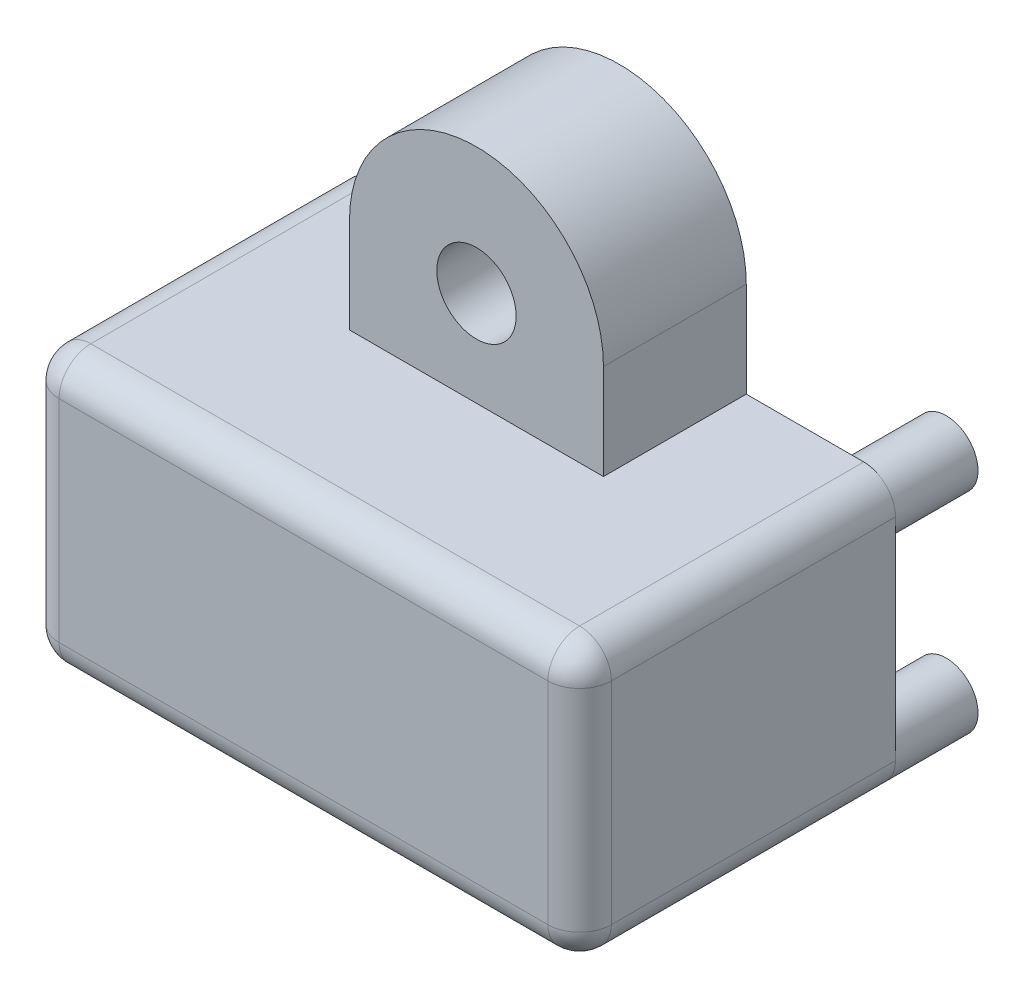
ISO-10303-21;
HEADER;
FILE_DESCRIPTION(('STEP AP214'),'2;1');
FILE_NAME('part.step','',(''),(''),'','','');
FILE_SCHEMA(('AUTOMOTIVE_DESIGN { 1 0 10303 214 1 1 1 1 }'));
ENDSEC;
DATA;
#1=APPLICATION_CONTEXT('core data for automotive mechanical design processes');
#2=APPLICATION_PROTOCOL_DEFINITION('international standard','automotive_design',2000,#1);
#3=PRODUCT_CONTEXT('',#1,'mechanical');
#4=PRODUCT('Part','Part','',(#3));
#5=PRODUCT_RELATED_PRODUCT_CATEGORY('part','',(#4));
#6=PRODUCT_DEFINITION_FORMATION('','',#4);
#7=PRODUCT_DEFINITION_CONTEXT('part definition',#1,'design');
#8=PRODUCT_DEFINITION('design','',#6,#7);
#9=PRODUCT_DEFINITION_SHAPE('','',#8);
#10=(LENGTH_UNIT() NAMED_UNIT(*) SI_UNIT(.MILLI.,.METRE.));
#11=(NAMED_UNIT(*) PLANE_ANGLE_UNIT() SI_UNIT($,.RADIAN.));
#12=(NAMED_UNIT(*) SI_UNIT($,.STERADIAN.) SOLID_ANGLE_UNIT());
#13=UNCERTAINTY_MEASURE_WITH_UNIT(LENGTH_MEASURE(1.E-05),#10,'distance_accuracy_value','');
#14=(GEOMETRIC_REPRESENTATION_CONTEXT(3) GLOBAL_UNCERTAINTY_ASSIGNED_CONTEXT((#13)) GLOBAL_UNIT_ASSIGNED_CONTEXT((#10,
#11,#12)) REPRESENTATION_CONTEXT('',''));
#15=CARTESIAN_POINT('',(0.,0.,0.));
#16=DIRECTION('',(0.,0.,1.));
#17=DIRECTION('',(1.,0.,0.));
#18=AXIS2_PLACEMENT_3D('',#15,#16,#17);
#19=CARTESIAN_POINT('',(0.,0.,0.));
#20=DIRECTION('',(0.,0.,1.));
#21=DIRECTION('',(1.,0.,0.));
#22=AXIS2_PLACEMENT_3D('',#19,#20,#21);
#23=PLANE('',#22);
#24=CARTESIAN_POINT('',(-33.6389312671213,39.2224252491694,0.));
#25=DIRECTION('',(0.,0.,-1.));
#26=DIRECTION('',(-1.,0.,0.));
#27=AXIS2_PLACEMENT_3D('',#24,#25,#26);
#28=CIRCLE('',#27,2.6);
#29=CARTESIAN_POINT('',(-36.2389312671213,39.2224252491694,0.));
#30=VERTEX_POINT('',#29);
#31=EDGE_CURVE('E258',#30,#30,#28,.T.);
#32=ORIENTED_EDGE('',*,*,#31,.F.);
#33=EDGE_LOOP('',(#32));
#34=FACE_BOUND('',#33,.T.);
#35=DIRECTION('',(-1.,0.,0.));
#36=VECTOR('',#35,1.);
#37=CARTESIAN_POINT('',(-42.3389312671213,36.2224252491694,0.));
#38=LINE('',#37,#36);
#39=CARTESIAN_POINT('',(-25.9389312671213,36.2224252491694,0.));
#40=VERTEX_POINT('',#39);
#41=CARTESIAN_POINT('',(-29.6389312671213,36.2224252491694,0.));
#42=VERTEX_POINT('',#41);
#43=EDGE_CURVE('E173',#40,#42,#38,.T.);
#44=ORIENTED_EDGE('',*,*,#43,.F.);
#45=CARTESIAN_POINT('',(-25.9389312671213,35.2224252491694,0.));
#46=DIRECTION('',(0.,0.,1.));
#47=DIRECTION('',(1.,0.,0.));
#48=AXIS2_PLACEMENT_3D('',#45,#46,#47);
#49=CIRCLE('',#48,1.);
#50=CARTESIAN_POINT('',(-24.9389312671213,35.2224252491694,0.));
#51=VERTEX_POINT('',#50);
#52=EDGE_CURVE('E11',#40,#51,#49,.F.);
#53=ORIENTED_EDGE('',*,*,#52,.T.);
#54=DIRECTION('',(0.,1.,0.));
#55=VECTOR('',#54,1.);
#56=CARTESIAN_POINT('',(-24.9389312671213,36.2224252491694,0.));
#57=LINE('',#56,#55);
#58=CARTESIAN_POINT('',(-24.9389312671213,35.1849364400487,0.));
#59=VERTEX_POINT('',#58);
#60=EDGE_CURVE('E164',#59,#51,#57,.T.);
#61=ORIENTED_EDGE('',*,*,#60,.F.);
#62=CARTESIAN_POINT('',(-25.9389312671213,35.1849364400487,0.));
#63=DIRECTION('',(0.,0.,-1.));
#64=DIRECTION('',(-1.,0.,0.));
#65=AXIS2_PLACEMENT_3D('',#62,#63,#64);
#66=CIRCLE('',#65,1.);
#67=EDGE_CURVE('E251',#59,#59,#66,.T.);
#68=ORIENTED_EDGE('',*,*,#67,.F.);
#69=CARTESIAN_POINT('',(-24.9389312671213,28.5724252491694,0.));
#70=VERTEX_POINT('',#69);
#71=EDGE_CURVE('E165',#70,#59,#57,.T.);
#72=ORIENTED_EDGE('',*,*,#71,.F.);
#73=CARTESIAN_POINT('',(-25.9389312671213,28.5724252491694,0.));
#74=DIRECTION('',(0.,0.,-1.));
#75=DIRECTION('',(-1.,0.,0.));
#76=AXIS2_PLACEMENT_3D('',#73,#74,#75);
#77=CIRCLE('',#76,1.);
#78=CARTESIAN_POINT('',(-25.9389312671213,27.5724252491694,0.));
#79=VERTEX_POINT('',#78);
#80=EDGE_CURVE('E245',#79,#70,#77,.T.);
#81=ORIENTED_EDGE('',*,*,#80,.F.);
#82=DIRECTION('',(1.,0.,0.));
#83=VECTOR('',#82,1.);
#84=CARTESIAN_POINT('',(-42.3389312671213,27.5724252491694,0.));
#85=LINE('',#84,#83);
#86=CARTESIAN_POINT('',(-41.3389312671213,27.5724252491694,0.));
#87=VERTEX_POINT('',#86);
#88=EDGE_CURVE('E147',#87,#79,#85,.T.);
#89=ORIENTED_EDGE('',*,*,#88,.F.);
#90=CARTESIAN_POINT('',(-41.3389312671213,28.5724252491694,0.));
#91=DIRECTION('',(0.,0.,-1.));
#92=DIRECTION('',(1.,0.,0.));
#93=AXIS2_PLACEMENT_3D('',#90,#91,#92);
#94=CIRCLE('',#93,0.999999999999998);
#95=CARTESIAN_POINT('',(-42.3389312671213,28.5724252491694,0.));
#96=VERTEX_POINT('',#95);
#97=EDGE_CURVE('E154',#96,#87,#94,.T.);
#98=ORIENTED_EDGE('',*,*,#97,.F.);
#99=DIRECTION('',(0.,-1.,0.));
#100=VECTOR('',#99,1.);
#101=CARTESIAN_POINT('',(-42.3389312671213,36.2224252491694,0.));
#102=LINE('',#101,#100);
#103=CARTESIAN_POINT('',(-42.3389312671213,35.1849364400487,0.));
#104=VERTEX_POINT('',#103);
#105=EDGE_CURVE('E141',#104,#96,#102,.T.);
#106=ORIENTED_EDGE('',*,*,#105,.F.);
#107=CARTESIAN_POINT('',(-41.3389312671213,35.1849364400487,0.));
#108=DIRECTION('',(0.,0.,-1.));
#109=DIRECTION('',(1.,0.,0.));
#110=AXIS2_PLACEMENT_3D('',#107,#108,#109);
#111=CIRCLE('',#110,0.999999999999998);
#112=EDGE_CURVE('E151',#104,#104,#111,.T.);
#113=ORIENTED_EDGE('',*,*,#112,.F.);
#114=CARTESIAN_POINT('',(-42.3389312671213,35.2224252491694,0.));
#115=VERTEX_POINT('',#114);
#116=EDGE_CURVE('E138',#115,#104,#102,.T.);
#117=ORIENTED_EDGE('',*,*,#116,.F.);
#118=CARTESIAN_POINT('',(-41.3389312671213,35.2224252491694,0.));
#119=DIRECTION('',(0.,0.,1.));
#120=DIRECTION('',(1.,0.,0.));
#121=AXIS2_PLACEMENT_3D('',#118,#119,#120);
#122=CIRCLE('',#121,1.);
#123=CARTESIAN_POINT('',(-41.3389312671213,36.2224252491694,0.));
#124=VERTEX_POINT('',#123);
#125=EDGE_CURVE('E42',#115,#124,#122,.F.);
#126=ORIENTED_EDGE('',*,*,#125,.T.);
#127=CARTESIAN_POINT('',(-37.6389312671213,36.2224252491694,0.));
#128=VERTEX_POINT('',#127);
#129=EDGE_CURVE('E167',#128,#124,#38,.T.);
#130=ORIENTED_EDGE('',*,*,#129,.F.);
#131=DIRECTION('',(0.,1.,0.));
#132=VECTOR('',#131,1.);
#133=CARTESIAN_POINT('',(-37.6389312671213,39.2224252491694,0.));
#134=LINE('',#133,#132);
#135=CARTESIAN_POINT('',(-37.6389312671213,39.2224252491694,0.));
#136=VERTEX_POINT('',#135);
#137=EDGE_CURVE('E275',#128,#136,#134,.T.);
#138=ORIENTED_EDGE('',*,*,#137,.T.);
#139=CARTESIAN_POINT('',(-33.6389312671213,39.2224252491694,0.));
#140=DIRECTION('',(0.,0.,-1.));
#141=DIRECTION('',(-1.,0.,0.));
#142=AXIS2_PLACEMENT_3D('',#139,#140,#141);
#143=CIRCLE('',#142,4.);
#144=CARTESIAN_POINT('',(-29.6389312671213,39.2224252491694,0.));
#145=VERTEX_POINT('',#144);
#146=EDGE_CURVE('E270',#136,#145,#143,.T.);
#147=ORIENTED_EDGE('',*,*,#146,.T.);
#148=DIRECTION('',(0.,-1.,0.));
#149=VECTOR('',#148,1.);
#150=CARTESIAN_POINT('',(-29.6389312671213,39.2224252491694,0.));
#151=LINE('',#150,#149);
#152=EDGE_CURVE('E285',#145,#42,#151,.T.);
#153=ORIENTED_EDGE('',*,*,#152,.T.);
#154=EDGE_LOOP('',(#44,#53,#61,#68,#72,#81,#89,#98,#106,#113,#117,#126,#130,#138,#147,#153));
#155=FACE_BOUND('',#154,.T.);
#156=ADVANCED_FACE('F33',(#34,#155),#23,.F.);
#157=CARTESIAN_POINT('',(-33.6389312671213,39.2224252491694,4.5));
#158=DIRECTION('',(0.,0.,-1.));
#159=DIRECTION('',(-1.,0.,0.));
#160=AXIS2_PLACEMENT_3D('',#157,#158,#159);
#161=CYLINDRICAL_SURFACE('',#160,1.25);
#162=CARTESIAN_POINT('',(-33.6389312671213,39.2224252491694,4.5));
#163=DIRECTION('',(0.,0.,-1.));
#164=DIRECTION('',(-1.,0.,0.));
#165=AXIS2_PLACEMENT_3D('',#162,#163,#164);
#166=CIRCLE('',#165,1.25);
#167=CARTESIAN_POINT('',(-34.8889312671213,39.2224252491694,4.5));
#168=VERTEX_POINT('',#167);
#169=EDGE_CURVE('E267',#168,#168,#166,.T.);
#170=ORIENTED_EDGE('',*,*,#169,.F.);
#171=EDGE_LOOP('',(#170));
#172=FACE_BOUND('',#171,.T.);
#173=CARTESIAN_POINT('',(-33.6389312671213,39.2224252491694,2.));
#174=DIRECTION('',(0.,0.,-1.));
#175=DIRECTION('',(-1.,0.,0.));
#176=AXIS2_PLACEMENT_3D('',#173,#174,#175);
#177=CIRCLE('',#176,1.25);
#178=CARTESIAN_POINT('',(-34.8889312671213,39.2224252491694,2.));
#179=VERTEX_POINT('',#178);
#180=EDGE_CURVE('E264',#179,#179,#177,.F.);
#181=ORIENTED_EDGE('',*,*,#180,.F.);
#182=EDGE_LOOP('',(#181));
#183=FACE_BOUND('',#182,.T.);
#184=ADVANCED_FACE('F377',(#172,#183),#161,.F.);
#185=CARTESIAN_POINT('',(-42.3389312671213,36.2224252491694,9.95));
#186=DIRECTION('',(0.,-1.,0.));
#187=DIRECTION('',(0.,0.,-1.));
#188=AXIS2_PLACEMENT_3D('',#185,#186,#187);
#189=PLANE('',#188);
#190=DIRECTION('',(-1.,0.,0.));
#191=VECTOR('',#190,1.);
#192=CARTESIAN_POINT('',(-24.9389312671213,36.2224252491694,8.95));
#193=LINE('',#192,#191);
#194=CARTESIAN_POINT('',(-41.3389312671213,36.2224252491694,8.95));
#195=VERTEX_POINT('',#194);
#196=CARTESIAN_POINT('',(-25.9389312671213,36.2224252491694,8.95));
#197=VERTEX_POINT('',#196);
#198=EDGE_CURVE('E181',#195,#197,#193,.F.);
#199=ORIENTED_EDGE('',*,*,#198,.T.);
#200=DIRECTION('',(0.,0.,-1.));
#201=VECTOR('',#200,1.);
#202=CARTESIAN_POINT('',(-25.9389312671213,36.2224252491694,9.95));
#203=LINE('',#202,#201);
#204=EDGE_CURVE('E184',#197,#40,#203,.T.);
#205=ORIENTED_EDGE('',*,*,#204,.T.);
#206=ORIENTED_EDGE('',*,*,#43,.T.);
#207=DIRECTION('',(0.,0.,-1.));
#208=VECTOR('',#207,1.);
#209=CARTESIAN_POINT('',(-29.6389312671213,36.2224252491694,4.5));
#210=LINE('',#209,#208);
#211=CARTESIAN_POINT('',(-29.6389312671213,36.2224252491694,4.5));
#212=VERTEX_POINT('',#211);
#213=EDGE_CURVE('E291',#212,#42,#210,.T.);
#214=ORIENTED_EDGE('',*,*,#213,.F.);
#215=DIRECTION('',(-1.,0.,0.));
#216=VECTOR('',#215,1.);
#217=CARTESIAN_POINT('',(-37.6389312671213,36.2224252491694,4.5));
#218=LINE('',#217,#216);
#219=CARTESIAN_POINT('',(-37.6389312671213,36.2224252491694,4.5));
#220=VERTEX_POINT('',#219);
#221=EDGE_CURVE('E278',#212,#220,#218,.T.);
#222=ORIENTED_EDGE('',*,*,#221,.T.);
#223=DIRECTION('',(0.,0.,-1.));
#224=VECTOR('',#223,1.);
#225=CARTESIAN_POINT('',(-37.6389312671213,36.2224252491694,4.5));
#226=LINE('',#225,#224);
#227=EDGE_CURVE('E157',#220,#128,#226,.T.);
#228=ORIENTED_EDGE('',*,*,#227,.T.);
#229=ORIENTED_EDGE('',*,*,#129,.T.);
#230=DIRECTION('',(0.,0.,-1.));
#231=VECTOR('',#230,1.);
#232=CARTESIAN_POINT('',(-41.3389312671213,36.2224252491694,9.95));
#233=LINE('',#232,#231);
#234=EDGE_CURVE('E179',#124,#195,#233,.F.);
#235=ORIENTED_EDGE('',*,*,#234,.T.);
#236=EDGE_LOOP('',(#199,#205,#206,#214,#222,#228,#229,#235));
#237=FACE_BOUND('',#236,.T.);
#238=ADVANCED_FACE('F345',(#237),#189,.F.);
#239=CARTESIAN_POINT('',(-42.3389312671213,36.2224252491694,9.95));
#240=DIRECTION('',(1.,0.,0.));
#241=DIRECTION('',(0.,0.,-1.));
#242=AXIS2_PLACEMENT_3D('',#239,#240,#241);
#243=PLANE('',#242);
#244=ORIENTED_EDGE('',*,*,#105,.T.);
#245=DIRECTION('',(0.,0.,-1.));
#246=VECTOR('',#245,1.);
#247=CARTESIAN_POINT('',(-42.3389312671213,28.5724252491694,9.95));
#248=LINE('',#247,#246);
#249=CARTESIAN_POINT('',(-42.3389312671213,28.5724252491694,8.95));
#250=VERTEX_POINT('',#249);
#251=EDGE_CURVE('E50',#96,#250,#248,.F.);
#252=ORIENTED_EDGE('',*,*,#251,.T.);
#253=DIRECTION('',(0.,-1.,0.));
#254=VECTOR('',#253,1.);
#255=CARTESIAN_POINT('',(-42.3389312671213,36.2224252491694,8.95));
#256=LINE('',#255,#254);
#257=CARTESIAN_POINT('',(-42.3389312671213,35.2224252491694,8.95));
#258=VERTEX_POINT('',#257);
#259=EDGE_CURVE('E55',#250,#258,#256,.F.);
#260=ORIENTED_EDGE('',*,*,#259,.T.);
#261=DIRECTION('',(0.,0.,-1.));
#262=VECTOR('',#261,1.);
#263=CARTESIAN_POINT('',(-42.3389312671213,35.2224252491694,9.95));
#264=LINE('',#263,#262);
#265=EDGE_CURVE('E143',#258,#115,#264,.T.);
#266=ORIENTED_EDGE('',*,*,#265,.T.);
#267=ORIENTED_EDGE('',*,*,#116,.T.);
#268=EDGE_LOOP('',(#244,#252,#260,#266,#267));
#269=FACE_BOUND('',#268,.T.);
#270=ADVANCED_FACE('F140',(#269),#243,.F.);
#271=CARTESIAN_POINT('',(-42.3389312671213,27.5724252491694,9.95));
#272=DIRECTION('',(0.,1.,0.));
#273=DIRECTION('',(0.,0.,1.));
#274=AXIS2_PLACEMENT_3D('',#271,#272,#273);
#275=PLANE('',#274);
#276=ORIENTED_EDGE('',*,*,#88,.T.);
#277=DIRECTION('',(0.,0.,-1.));
#278=VECTOR('',#277,1.);
#279=CARTESIAN_POINT('',(-25.9389312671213,27.5724252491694,9.95));
#280=LINE('',#279,#278);
#281=CARTESIAN_POINT('',(-25.9389312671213,27.5724252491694,8.95));
#282=VERTEX_POINT('',#281);
#283=EDGE_CURVE('E196',#79,#282,#280,.F.);
#284=ORIENTED_EDGE('',*,*,#283,.T.);
#285=DIRECTION('',(1.,0.,0.));
#286=VECTOR('',#285,1.);
#287=CARTESIAN_POINT('',(-42.3389312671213,27.5724252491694,8.95));
#288=LINE('',#287,#286);
#289=CARTESIAN_POINT('',(-41.3389312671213,27.5724252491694,8.95));
#290=VERTEX_POINT('',#289);
#291=EDGE_CURVE('E194',#282,#290,#288,.F.);
#292=ORIENTED_EDGE('',*,*,#291,.T.);
#293=DIRECTION('',(0.,0.,-1.));
#294=VECTOR('',#293,1.);
#295=CARTESIAN_POINT('',(-41.3389312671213,27.5724252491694,9.95));
#296=LINE('',#295,#294);
#297=EDGE_CURVE('E192',#290,#87,#296,.T.);
#298=ORIENTED_EDGE('',*,*,#297,.T.);
#299=EDGE_LOOP('',(#276,#284,#292,#298));
#300=FACE_BOUND('',#299,.T.);
#301=ADVANCED_FACE('F391',(#300),#275,.F.);
#302=CARTESIAN_POINT('',(-24.9389312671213,36.2224252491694,9.95));
#303=DIRECTION('',(-1.,0.,0.));
#304=DIRECTION('',(0.,0.,1.));
#305=AXIS2_PLACEMENT_3D('',#302,#303,#304);
#306=PLANE('',#305);
#307=DIRECTION('',(0.,1.,0.));
#308=VECTOR('',#307,1.);
#309=CARTESIAN_POINT('',(-24.9389312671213,27.5724252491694,8.95));
#310=LINE('',#309,#308);
#311=CARTESIAN_POINT('',(-24.9389312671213,35.2224252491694,8.95));
#312=VERTEX_POINT('',#311);
#313=CARTESIAN_POINT('',(-24.9389312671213,28.5724252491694,8.95));
#314=VERTEX_POINT('',#313);
#315=EDGE_CURVE('E188',#312,#314,#310,.F.);
#316=ORIENTED_EDGE('',*,*,#315,.T.);
#317=DIRECTION('',(0.,0.,-1.));
#318=VECTOR('',#317,1.);
#319=CARTESIAN_POINT('',(-24.9389312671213,28.5724252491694,9.95));
#320=LINE('',#319,#318);
#321=EDGE_CURVE('E190',#314,#70,#320,.T.);
#322=ORIENTED_EDGE('',*,*,#321,.T.);
#323=ORIENTED_EDGE('',*,*,#71,.T.);
#324=ORIENTED_EDGE('',*,*,#60,.T.);
#325=DIRECTION('',(0.,0.,-1.));
#326=VECTOR('',#325,1.);
#327=CARTESIAN_POINT('',(-24.9389312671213,35.2224252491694,9.95));
#328=LINE('',#327,#326);
#329=EDGE_CURVE('E186',#51,#312,#328,.F.);
#330=ORIENTED_EDGE('',*,*,#329,.T.);
#331=EDGE_LOOP('',(#316,#322,#323,#324,#330));
#332=FACE_BOUND('',#331,.T.);
#333=ADVANCED_FACE('F373',(#332),#306,.F.);
#334=CARTESIAN_POINT('',(0.,0.,9.95));
#335=DIRECTION('',(0.,0.,1.));
#336=DIRECTION('',(1.,0.,0.));
#337=AXIS2_PLACEMENT_3D('',#334,#335,#336);
#338=PLANE('',#337);
#339=DIRECTION('',(0.,1.,0.));
#340=VECTOR('',#339,1.);
#341=CARTESIAN_POINT('',(-25.9389312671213,36.2224252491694,9.95));
#342=LINE('',#341,#340);
#343=CARTESIAN_POINT('',(-25.9389312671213,28.5724252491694,9.95));
#344=VERTEX_POINT('',#343);
#345=CARTESIAN_POINT('',(-25.9389312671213,35.2224252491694,9.95));
#346=VERTEX_POINT('',#345);
#347=EDGE_CURVE('E305',#344,#346,#342,.T.);
#348=ORIENTED_EDGE('',*,*,#347,.T.);
#349=DIRECTION('',(-1.,0.,0.));
#350=VECTOR('',#349,1.);
#351=CARTESIAN_POINT('',(-42.3389312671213,35.2224252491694,9.95));
#352=LINE('',#351,#350);
#353=CARTESIAN_POINT('',(-41.3389312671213,35.2224252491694,9.95));
#354=VERTEX_POINT('',#353);
#355=EDGE_CURVE('E177',#346,#354,#352,.T.);
#356=ORIENTED_EDGE('',*,*,#355,.T.);
#357=DIRECTION('',(0.,-1.,0.));
#358=VECTOR('',#357,1.);
#359=CARTESIAN_POINT('',(-41.3389312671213,27.5724252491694,9.95));
#360=LINE('',#359,#358);
#361=CARTESIAN_POINT('',(-41.3389312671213,28.5724252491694,9.95));
#362=VERTEX_POINT('',#361);
#363=EDGE_CURVE('E176',#354,#362,#360,.T.);
#364=ORIENTED_EDGE('',*,*,#363,.T.);
#365=DIRECTION('',(1.,0.,0.));
#366=VECTOR('',#365,1.);
#367=CARTESIAN_POINT('',(-24.9389312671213,28.5724252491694,9.95));
#368=LINE('',#367,#366);
#369=EDGE_CURVE('E304',#362,#344,#368,.T.);
#370=ORIENTED_EDGE('',*,*,#369,.T.);
#371=EDGE_LOOP('',(#348,#356,#364,#370));
#372=FACE_BOUND('',#371,.T.);
#373=ADVANCED_FACE('F311',(#372),#338,.T.);
#374=CARTESIAN_POINT('',(-33.6389312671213,39.2224252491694,4.5));
#375=DIRECTION('',(0.,0.,-1.));
#376=DIRECTION('',(-1.,0.,0.));
#377=AXIS2_PLACEMENT_3D('',#374,#375,#376);
#378=CYLINDRICAL_SURFACE('',#377,4.);
#379=ORIENTED_EDGE('',*,*,#146,.F.);
#380=DIRECTION('',(0.,0.,-1.));
#381=VECTOR('',#380,1.);
#382=CARTESIAN_POINT('',(-37.6389312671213,39.2224252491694,4.5));
#383=LINE('',#382,#381);
#384=CARTESIAN_POINT('',(-37.6389312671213,39.2224252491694,4.5));
#385=VERTEX_POINT('',#384);
#386=EDGE_CURVE('E156',#385,#136,#383,.T.);
#387=ORIENTED_EDGE('',*,*,#386,.F.);
#388=CARTESIAN_POINT('',(-33.6389312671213,39.2224252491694,4.5));
#389=DIRECTION('',(0.,0.,-1.));
#390=DIRECTION('',(-1.,0.,0.));
#391=AXIS2_PLACEMENT_3D('',#388,#389,#390);
#392=CIRCLE('',#391,4.);
#393=CARTESIAN_POINT('',(-29.6389312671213,39.2224252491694,4.5));
#394=VERTEX_POINT('',#393);
#395=EDGE_CURVE('E271',#385,#394,#392,.T.);
#396=ORIENTED_EDGE('',*,*,#395,.T.);
#397=DIRECTION('',(0.,0.,-1.));
#398=VECTOR('',#397,1.);
#399=CARTESIAN_POINT('',(-29.6389312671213,39.2224252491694,4.5));
#400=LINE('',#399,#398);
#401=EDGE_CURVE('E161',#394,#145,#400,.T.);
#402=ORIENTED_EDGE('',*,*,#401,.T.);
#403=EDGE_LOOP('',(#379,#387,#396,#402));
#404=FACE_BOUND('',#403,.T.);
#405=ADVANCED_FACE('F365',(#404),#378,.T.);
#406=CARTESIAN_POINT('',(-37.6389312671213,39.2224252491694,4.5));
#407=DIRECTION('',(-1.,0.,0.));
#408=DIRECTION('',(0.,0.,1.));
#409=AXIS2_PLACEMENT_3D('',#406,#407,#408);
#410=PLANE('',#409);
#411=ORIENTED_EDGE('',*,*,#137,.F.);
#412=ORIENTED_EDGE('',*,*,#227,.F.);
#413=DIRECTION('',(0.,1.,0.));
#414=VECTOR('',#413,1.);
#415=CARTESIAN_POINT('',(-37.6389312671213,39.2224252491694,4.5));
#416=LINE('',#415,#414);
#417=EDGE_CURVE('E281',#220,#385,#416,.T.);
#418=ORIENTED_EDGE('',*,*,#417,.T.);
#419=ORIENTED_EDGE('',*,*,#386,.T.);
#420=EDGE_LOOP('',(#411,#412,#418,#419));
#421=FACE_BOUND('',#420,.T.);
#422=ADVANCED_FACE('F354',(#421),#410,.T.);
#423=CARTESIAN_POINT('',(-29.6389312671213,39.2224252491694,4.5));
#424=DIRECTION('',(1.,0.,0.));
#425=DIRECTION('',(0.,0.,-1.));
#426=AXIS2_PLACEMENT_3D('',#423,#424,#425);
#427=PLANE('',#426);
#428=ORIENTED_EDGE('',*,*,#152,.F.);
#429=ORIENTED_EDGE('',*,*,#401,.F.);
#430=DIRECTION('',(0.,-1.,0.));
#431=VECTOR('',#430,1.);
#432=CARTESIAN_POINT('',(-29.6389312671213,39.2224252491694,4.5));
#433=LINE('',#432,#431);
#434=EDGE_CURVE('E274',#394,#212,#433,.T.);
#435=ORIENTED_EDGE('',*,*,#434,.T.);
#436=ORIENTED_EDGE('',*,*,#213,.T.);
#437=EDGE_LOOP('',(#428,#429,#435,#436));
#438=FACE_BOUND('',#437,.T.);
#439=ADVANCED_FACE('F363',(#438),#427,.T.);
#440=CARTESIAN_POINT('',(-33.6389312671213,39.2224252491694,4.5));
#441=DIRECTION('',(0.,0.,-1.));
#442=DIRECTION('',(-1.,0.,0.));
#443=AXIS2_PLACEMENT_3D('',#440,#441,#442);
#444=PLANE('',#443);
#445=ORIENTED_EDGE('',*,*,#169,.T.);
#446=EDGE_LOOP('',(#445));
#447=FACE_BOUND('',#446,.T.);
#448=ORIENTED_EDGE('',*,*,#395,.F.);
#449=ORIENTED_EDGE('',*,*,#417,.F.);
#450=ORIENTED_EDGE('',*,*,#221,.F.);
#451=ORIENTED_EDGE('',*,*,#434,.F.);
#452=EDGE_LOOP('',(#448,#449,#450,#451));
#453=FACE_BOUND('',#452,.T.);
#454=ADVANCED_FACE('F360',(#447,#453),#444,.F.);
#455=CARTESIAN_POINT('',(-33.6389312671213,39.2224252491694,2.));
#456=DIRECTION('',(0.,0.,-1.));
#457=DIRECTION('',(-1.,0.,0.));
#458=AXIS2_PLACEMENT_3D('',#455,#456,#457);
#459=PLANE('',#458);
#460=CARTESIAN_POINT('',(-33.6389312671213,39.2224252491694,2.));
#461=DIRECTION('',(0.,0.,-1.));
#462=DIRECTION('',(-1.,0.,0.));
#463=AXIS2_PLACEMENT_3D('',#460,#461,#462);
#464=CIRCLE('',#463,2.6);
#465=CARTESIAN_POINT('',(-36.2389312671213,39.2224252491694,2.));
#466=VERTEX_POINT('',#465);
#467=EDGE_CURVE('E261',#466,#466,#464,.T.);
#468=ORIENTED_EDGE('',*,*,#467,.T.);
#469=EDGE_LOOP('',(#468));
#470=FACE_BOUND('',#469,.T.);
#471=ORIENTED_EDGE('',*,*,#180,.T.);
#472=EDGE_LOOP('',(#471));
#473=FACE_BOUND('',#472,.T.);
#474=ADVANCED_FACE('F455',(#470,#473),#459,.T.);
#475=CARTESIAN_POINT('',(-33.6389312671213,39.2224252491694,2.));
#476=DIRECTION('',(0.,0.,-1.));
#477=DIRECTION('',(-1.,0.,0.));
#478=AXIS2_PLACEMENT_3D('',#475,#476,#477);
#479=CYLINDRICAL_SURFACE('',#478,2.6);
#480=ORIENTED_EDGE('',*,*,#467,.F.);
#481=EDGE_LOOP('',(#480));
#482=FACE_BOUND('',#481,.T.);
#483=ORIENTED_EDGE('',*,*,#31,.T.);
#484=EDGE_LOOP('',(#483));
#485=FACE_BOUND('',#484,.T.);
#486=ADVANCED_FACE('F446',(#482,#485),#479,.F.);
#487=CARTESIAN_POINT('',(-25.9389312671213,35.1849364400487,-2.6));
#488=DIRECTION('',(0.,0.,1.));
#489=DIRECTION('',(1.,0.,0.));
#490=AXIS2_PLACEMENT_3D('',#487,#488,#489);
#491=CYLINDRICAL_SURFACE('',#490,1.);
#492=CARTESIAN_POINT('',(-25.9389312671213,35.1849364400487,-2.6));
#493=DIRECTION('',(0.,0.,-1.));
#494=DIRECTION('',(-1.,0.,0.));
#495=AXIS2_PLACEMENT_3D('',#492,#493,#494);
#496=CIRCLE('',#495,1.);
#497=CARTESIAN_POINT('',(-26.9389312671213,35.1849364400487,-2.6));
#498=VERTEX_POINT('',#497);
#499=EDGE_CURVE('E255',#498,#498,#496,.T.);
#500=ORIENTED_EDGE('',*,*,#499,.F.);
#501=EDGE_LOOP('',(#500));
#502=FACE_BOUND('',#501,.T.);
#503=ORIENTED_EDGE('',*,*,#67,.T.);
#504=EDGE_LOOP('',(#503));
#505=FACE_BOUND('',#504,.T.);
#506=ADVANCED_FACE('F443',(#502,#505),#491,.T.);
#507=CARTESIAN_POINT('',(-25.9389312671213,35.1849364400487,-2.6));
#508=DIRECTION('',(0.,0.,-1.));
#509=DIRECTION('',(-1.,0.,0.));
#510=AXIS2_PLACEMENT_3D('',#507,#508,#509);
#511=PLANE('',#510);
#512=ORIENTED_EDGE('',*,*,#499,.T.);
#513=EDGE_LOOP('',(#512));
#514=FACE_BOUND('',#513,.T.);
#515=ADVANCED_FACE('F445',(#514),#511,.T.);
#516=CARTESIAN_POINT('',(-25.9389312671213,28.5724252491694,-2.6));
#517=DIRECTION('',(0.,0.,1.));
#518=DIRECTION('',(1.,0.,0.));
#519=AXIS2_PLACEMENT_3D('',#516,#517,#518);
#520=CYLINDRICAL_SURFACE('',#519,1.);
#521=CARTESIAN_POINT('',(-25.9389312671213,28.5724252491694,-2.6));
#522=DIRECTION('',(0.,0.,-1.));
#523=DIRECTION('',(-1.,0.,0.));
#524=AXIS2_PLACEMENT_3D('',#521,#522,#523);
#525=CIRCLE('',#524,1.);
#526=CARTESIAN_POINT('',(-26.9389312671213,28.5724252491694,-2.6));
#527=VERTEX_POINT('',#526);
#528=EDGE_CURVE('E248',#527,#527,#525,.T.);
#529=ORIENTED_EDGE('',*,*,#528,.F.);
#530=EDGE_LOOP('',(#529));
#531=FACE_BOUND('',#530,.T.);
#532=EDGE_CURVE('E252',#70,#79,#77,.T.);
#533=ORIENTED_EDGE('',*,*,#532,.T.);
#534=ORIENTED_EDGE('',*,*,#80,.T.);
#535=EDGE_LOOP('',(#533,#534));
#536=FACE_BOUND('',#535,.T.);
#537=ADVANCED_FACE('F436',(#531,#536),#520,.T.);
#538=CARTESIAN_POINT('',(-25.9389312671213,28.5724252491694,-2.6));
#539=DIRECTION('',(0.,0.,-1.));
#540=DIRECTION('',(-1.,0.,0.));
#541=AXIS2_PLACEMENT_3D('',#538,#539,#540);
#542=PLANE('',#541);
#543=ORIENTED_EDGE('',*,*,#528,.T.);
#544=EDGE_LOOP('',(#543));
#545=FACE_BOUND('',#544,.T.);
#546=ADVANCED_FACE('F503',(#545),#542,.T.);
#547=CARTESIAN_POINT('',(-41.3389312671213,28.5724252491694,-2.6));
#548=DIRECTION('',(0.,0.,1.));
#549=DIRECTION('',(1.,0.,0.));
#550=AXIS2_PLACEMENT_3D('',#547,#548,#549);
#551=CYLINDRICAL_SURFACE('',#550,0.999999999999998);
#552=CARTESIAN_POINT('',(-41.3389312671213,28.5724252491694,-2.6));
#553=DIRECTION('',(0.,0.,-1.));
#554=DIRECTION('',(1.,0.,0.));
#555=AXIS2_PLACEMENT_3D('',#552,#553,#554);
#556=CIRCLE('',#555,0.999999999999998);
#557=CARTESIAN_POINT('',(-40.3389312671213,28.5724252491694,-2.6));
#558=VERTEX_POINT('',#557);
#559=EDGE_CURVE('E242',#558,#558,#556,.T.);
#560=ORIENTED_EDGE('',*,*,#559,.F.);
#561=EDGE_LOOP('',(#560));
#562=FACE_BOUND('',#561,.T.);
#563=EDGE_CURVE('E246',#87,#96,#94,.T.);
#564=ORIENTED_EDGE('',*,*,#563,.T.);
#565=ORIENTED_EDGE('',*,*,#97,.T.);
#566=EDGE_LOOP('',(#564,#565));
#567=FACE_BOUND('',#566,.T.);
#568=ADVANCED_FACE('F508',(#562,#567),#551,.T.);
#569=CARTESIAN_POINT('',(-41.3389312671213,28.5724252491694,-2.6));
#570=DIRECTION('',(0.,0.,1.));
#571=DIRECTION('',(1.,0.,0.));
#572=AXIS2_PLACEMENT_3D('',#569,#570,#571);
#573=PLANE('',#572);
#574=ORIENTED_EDGE('',*,*,#559,.T.);
#575=EDGE_LOOP('',(#574));
#576=FACE_BOUND('',#575,.T.);
#577=ADVANCED_FACE('F516',(#576),#573,.F.);
#578=CARTESIAN_POINT('',(-41.3389312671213,35.1849364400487,-2.6));
#579=DIRECTION('',(0.,0.,1.));
#580=DIRECTION('',(1.,0.,0.));
#581=AXIS2_PLACEMENT_3D('',#578,#579,#580);
#582=CYLINDRICAL_SURFACE('',#581,0.999999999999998);
#583=CARTESIAN_POINT('',(-41.3389312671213,35.1849364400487,-2.6));
#584=DIRECTION('',(0.,0.,-1.));
#585=DIRECTION('',(1.,0.,0.));
#586=AXIS2_PLACEMENT_3D('',#583,#584,#585);
#587=CIRCLE('',#586,0.999999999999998);
#588=CARTESIAN_POINT('',(-40.3389312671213,35.1849364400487,-2.6));
#589=VERTEX_POINT('',#588);
#590=EDGE_CURVE('E236',#589,#589,#587,.T.);
#591=ORIENTED_EDGE('',*,*,#590,.F.);
#592=EDGE_LOOP('',(#591));
#593=FACE_BOUND('',#592,.T.);
#594=ORIENTED_EDGE('',*,*,#112,.T.);
#595=EDGE_LOOP('',(#594));
#596=FACE_BOUND('',#595,.T.);
#597=ADVANCED_FACE('F428',(#593,#596),#582,.T.);
#598=CARTESIAN_POINT('',(-41.3389312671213,35.1849364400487,-2.6));
#599=DIRECTION('',(0.,0.,1.));
#600=DIRECTION('',(1.,0.,0.));
#601=AXIS2_PLACEMENT_3D('',#598,#599,#600);
#602=PLANE('',#601);
#603=ORIENTED_EDGE('',*,*,#590,.T.);
#604=EDGE_LOOP('',(#603));
#605=FACE_BOUND('',#604,.T.);
#606=ADVANCED_FACE('F423',(#605),#602,.F.);
#607=CARTESIAN_POINT('',(-25.9389312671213,28.5724252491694,9.95));
#608=DIRECTION('',(0.,0.,-1.));
#609=DIRECTION('',(-1.,0.,0.));
#610=AXIS2_PLACEMENT_3D('',#607,#608,#609);
#611=CYLINDRICAL_SURFACE('',#610,1.);
#612=ORIENTED_EDGE('',*,*,#532,.F.);
#613=ORIENTED_EDGE('',*,*,#321,.F.);
#614=CARTESIAN_POINT('',(-25.9389312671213,28.5724252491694,8.95));
#615=DIRECTION('',(0.,0.,1.));
#616=DIRECTION('',(1.,0.,0.));
#617=AXIS2_PLACEMENT_3D('',#614,#615,#616);
#618=CIRCLE('',#617,1.);
#619=EDGE_CURVE('E37',#282,#314,#618,.T.);
#620=ORIENTED_EDGE('',*,*,#619,.F.);
#621=ORIENTED_EDGE('',*,*,#283,.F.);
#622=EDGE_LOOP('',(#612,#613,#620,#621));
#623=FACE_BOUND('',#622,.T.);
#624=ADVANCED_FACE('F35',(#623),#611,.T.);
#625=CARTESIAN_POINT('',(0.,28.5724252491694,8.95));
#626=DIRECTION('',(-1.,0.,0.));
#627=DIRECTION('',(0.,0.,1.));
#628=AXIS2_PLACEMENT_3D('',#625,#626,#627);
#629=CYLINDRICAL_SURFACE('',#628,1.);
#630=CARTESIAN_POINT('',(-41.3389312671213,28.5724252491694,8.95));
#631=DIRECTION('',(-1.,0.,0.));
#632=DIRECTION('',(0.,0.,1.));
#633=AXIS2_PLACEMENT_3D('',#630,#631,#632);
#634=CIRCLE('',#633,1.);
#635=EDGE_CURVE('E227',#290,#362,#634,.T.);
#636=ORIENTED_EDGE('',*,*,#635,.F.);
#637=ORIENTED_EDGE('',*,*,#291,.F.);
#638=CARTESIAN_POINT('',(-25.9389312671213,28.5724252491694,8.95));
#639=DIRECTION('',(1.,0.,0.));
#640=DIRECTION('',(0.,0.,-1.));
#641=AXIS2_PLACEMENT_3D('',#638,#639,#640);
#642=CIRCLE('',#641,1.);
#643=EDGE_CURVE('E229',#344,#282,#642,.T.);
#644=ORIENTED_EDGE('',*,*,#643,.F.);
#645=ORIENTED_EDGE('',*,*,#369,.F.);
#646=EDGE_LOOP('',(#636,#637,#644,#645));
#647=FACE_BOUND('',#646,.T.);
#648=ADVANCED_FACE('F331',(#647),#629,.T.);
#649=CARTESIAN_POINT('',(-41.3389312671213,28.5724252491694,9.95));
#650=DIRECTION('',(0.,0.,-1.));
#651=DIRECTION('',(-1.,0.,0.));
#652=AXIS2_PLACEMENT_3D('',#649,#650,#651);
#653=CYLINDRICAL_SURFACE('',#652,1.);
#654=ORIENTED_EDGE('',*,*,#563,.F.);
#655=ORIENTED_EDGE('',*,*,#297,.F.);
#656=CARTESIAN_POINT('',(-41.3389312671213,28.5724252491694,8.95));
#657=DIRECTION('',(0.,0.,1.));
#658=DIRECTION('',(1.,0.,0.));
#659=AXIS2_PLACEMENT_3D('',#656,#657,#658);
#660=CIRCLE('',#659,1.);
#661=EDGE_CURVE('E224',#250,#290,#660,.T.);
#662=ORIENTED_EDGE('',*,*,#661,.F.);
#663=ORIENTED_EDGE('',*,*,#251,.F.);
#664=EDGE_LOOP('',(#654,#655,#662,#663));
#665=FACE_BOUND('',#664,.T.);
#666=ADVANCED_FACE('F416',(#665),#653,.T.);
#667=CARTESIAN_POINT('',(-25.9389312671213,28.5724252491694,8.95));
#668=DIRECTION('',(0.,0.,1.));
#669=DIRECTION('',(1.,0.,0.));
#670=AXIS2_PLACEMENT_3D('',#667,#668,#669);
#671=SPHERICAL_SURFACE('',#670,1.);
#672=ORIENTED_EDGE('',*,*,#643,.T.);
#673=ORIENTED_EDGE('',*,*,#619,.T.);
#674=CARTESIAN_POINT('',(-25.9389312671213,28.5724252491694,8.95));
#675=DIRECTION('',(0.,-1.,0.));
#676=DIRECTION('',(0.,0.,-1.));
#677=AXIS2_PLACEMENT_3D('',#674,#675,#676);
#678=CIRCLE('',#677,1.);
#679=EDGE_CURVE('E221',#344,#314,#678,.F.);
#680=ORIENTED_EDGE('',*,*,#679,.F.);
#681=EDGE_LOOP('',(#672,#673,#680));
#682=FACE_BOUND('',#681,.T.);
#683=ADVANCED_FACE('F332',(#682),#671,.T.);
#684=CARTESIAN_POINT('',(-41.3389312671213,28.5724252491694,8.95));
#685=DIRECTION('',(0.,0.,1.));
#686=DIRECTION('',(1.,0.,0.));
#687=AXIS2_PLACEMENT_3D('',#684,#685,#686);
#688=SPHERICAL_SURFACE('',#687,1.);
#689=ORIENTED_EDGE('',*,*,#661,.T.);
#690=ORIENTED_EDGE('',*,*,#635,.T.);
#691=CARTESIAN_POINT('',(-41.3389312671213,28.5724252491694,8.95));
#692=DIRECTION('',(0.,-1.,0.));
#693=DIRECTION('',(0.,0.,-1.));
#694=AXIS2_PLACEMENT_3D('',#691,#692,#693);
#695=CIRCLE('',#694,1.);
#696=EDGE_CURVE('E218',#250,#362,#695,.F.);
#697=ORIENTED_EDGE('',*,*,#696,.F.);
#698=EDGE_LOOP('',(#689,#690,#697));
#699=FACE_BOUND('',#698,.T.);
#700=ADVANCED_FACE('F327',(#699),#688,.T.);
#701=CARTESIAN_POINT('',(-25.9389312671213,35.2224252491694,9.95));
#702=DIRECTION('',(0.,0.,-1.));
#703=DIRECTION('',(-1.,0.,0.));
#704=AXIS2_PLACEMENT_3D('',#701,#702,#703);
#705=CYLINDRICAL_SURFACE('',#704,1.);
#706=ORIENTED_EDGE('',*,*,#52,.F.);
#707=ORIENTED_EDGE('',*,*,#204,.F.);
#708=CARTESIAN_POINT('',(-25.9389312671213,35.2224252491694,8.95));
#709=DIRECTION('',(0.,0.,1.));
#710=DIRECTION('',(1.,0.,0.));
#711=AXIS2_PLACEMENT_3D('',#708,#709,#710);
#712=CIRCLE('',#711,1.);
#713=EDGE_CURVE('E215',#312,#197,#712,.T.);
#714=ORIENTED_EDGE('',*,*,#713,.F.);
#715=ORIENTED_EDGE('',*,*,#329,.F.);
#716=EDGE_LOOP('',(#706,#707,#714,#715));
#717=FACE_BOUND('',#716,.T.);
#718=ADVANCED_FACE('F343',(#717),#705,.T.);
#719=CARTESIAN_POINT('',(-25.9389312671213,0.,8.95));
#720=DIRECTION('',(0.,-1.,0.));
#721=DIRECTION('',(0.,0.,-1.));
#722=AXIS2_PLACEMENT_3D('',#719,#720,#721);
#723=CYLINDRICAL_SURFACE('',#722,1.);
#724=ORIENTED_EDGE('',*,*,#679,.T.);
#725=ORIENTED_EDGE('',*,*,#315,.F.);
#726=CARTESIAN_POINT('',(-25.9389312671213,35.2224252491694,8.95));
#727=DIRECTION('',(0.,1.,0.));
#728=DIRECTION('',(0.,0.,1.));
#729=AXIS2_PLACEMENT_3D('',#726,#727,#728);
#730=CIRCLE('',#729,1.);
#731=EDGE_CURVE('E212',#346,#312,#730,.T.);
#732=ORIENTED_EDGE('',*,*,#731,.F.);
#733=ORIENTED_EDGE('',*,*,#347,.F.);
#734=EDGE_LOOP('',(#724,#725,#732,#733));
#735=FACE_BOUND('',#734,.T.);
#736=ADVANCED_FACE('F335',(#735),#723,.T.);
#737=CARTESIAN_POINT('',(-41.3389312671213,0.,8.95));
#738=DIRECTION('',(0.,1.,0.));
#739=DIRECTION('',(0.,0.,1.));
#740=AXIS2_PLACEMENT_3D('',#737,#738,#739);
#741=CYLINDRICAL_SURFACE('',#740,1.);
#742=ORIENTED_EDGE('',*,*,#696,.T.);
#743=ORIENTED_EDGE('',*,*,#363,.F.);
#744=CARTESIAN_POINT('',(-41.3389312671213,35.2224252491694,8.95));
#745=DIRECTION('',(0.,1.,0.));
#746=DIRECTION('',(0.,0.,1.));
#747=AXIS2_PLACEMENT_3D('',#744,#745,#746);
#748=CIRCLE('',#747,1.);
#749=EDGE_CURVE('E209',#258,#354,#748,.T.);
#750=ORIENTED_EDGE('',*,*,#749,.F.);
#751=ORIENTED_EDGE('',*,*,#259,.F.);
#752=EDGE_LOOP('',(#742,#743,#750,#751));
#753=FACE_BOUND('',#752,.T.);
#754=ADVANCED_FACE('F324',(#753),#741,.T.);
#755=CARTESIAN_POINT('',(-41.3389312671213,35.2224252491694,9.95));
#756=DIRECTION('',(0.,0.,-1.));
#757=DIRECTION('',(-1.,0.,0.));
#758=AXIS2_PLACEMENT_3D('',#755,#756,#757);
#759=CYLINDRICAL_SURFACE('',#758,1.);
#760=ORIENTED_EDGE('',*,*,#125,.F.);
#761=ORIENTED_EDGE('',*,*,#265,.F.);
#762=CARTESIAN_POINT('',(-41.3389312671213,35.2224252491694,8.95));
#763=DIRECTION('',(0.,0.,1.));
#764=DIRECTION('',(1.,0.,0.));
#765=AXIS2_PLACEMENT_3D('',#762,#763,#764);
#766=CIRCLE('',#765,1.);
#767=EDGE_CURVE('E206',#195,#258,#766,.T.);
#768=ORIENTED_EDGE('',*,*,#767,.F.);
#769=ORIENTED_EDGE('',*,*,#234,.F.);
#770=EDGE_LOOP('',(#760,#761,#768,#769));
#771=FACE_BOUND('',#770,.T.);
#772=ADVANCED_FACE('F350',(#771),#759,.T.);
#773=CARTESIAN_POINT('',(-25.9389312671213,35.2224252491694,8.95));
#774=DIRECTION('',(0.,0.,1.));
#775=DIRECTION('',(1.,0.,0.));
#776=AXIS2_PLACEMENT_3D('',#773,#774,#775);
#777=SPHERICAL_SURFACE('',#776,1.);
#778=ORIENTED_EDGE('',*,*,#731,.T.);
#779=ORIENTED_EDGE('',*,*,#713,.T.);
#780=CARTESIAN_POINT('',(-25.9389312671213,35.2224252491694,8.95));
#781=DIRECTION('',(1.,0.,0.));
#782=DIRECTION('',(0.,0.,-1.));
#783=AXIS2_PLACEMENT_3D('',#780,#781,#782);
#784=CIRCLE('',#783,1.);
#785=EDGE_CURVE('E204',#346,#197,#784,.F.);
#786=ORIENTED_EDGE('',*,*,#785,.F.);
#787=EDGE_LOOP('',(#778,#779,#786));
#788=FACE_BOUND('',#787,.T.);
#789=ADVANCED_FACE('F338',(#788),#777,.T.);
#790=CARTESIAN_POINT('',(-41.3389312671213,35.2224252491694,8.95));
#791=DIRECTION('',(0.,0.,1.));
#792=DIRECTION('',(1.,0.,0.));
#793=AXIS2_PLACEMENT_3D('',#790,#791,#792);
#794=SPHERICAL_SURFACE('',#793,1.);
#795=ORIENTED_EDGE('',*,*,#767,.T.);
#796=ORIENTED_EDGE('',*,*,#749,.T.);
#797=CARTESIAN_POINT('',(-41.3389312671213,35.2224252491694,8.95));
#798=DIRECTION('',(-1.,0.,0.));
#799=DIRECTION('',(0.,0.,1.));
#800=AXIS2_PLACEMENT_3D('',#797,#798,#799);
#801=CIRCLE('',#800,1.);
#802=EDGE_CURVE('E202',#195,#354,#801,.F.);
#803=ORIENTED_EDGE('',*,*,#802,.F.);
#804=EDGE_LOOP('',(#795,#796,#803));
#805=FACE_BOUND('',#804,.T.);
#806=ADVANCED_FACE('F321',(#805),#794,.T.);
#807=CARTESIAN_POINT('',(0.,35.2224252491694,8.95));
#808=DIRECTION('',(1.,0.,0.));
#809=DIRECTION('',(0.,0.,-1.));
#810=AXIS2_PLACEMENT_3D('',#807,#808,#809);
#811=CYLINDRICAL_SURFACE('',#810,1.);
#812=ORIENTED_EDGE('',*,*,#785,.T.);
#813=ORIENTED_EDGE('',*,*,#198,.F.);
#814=ORIENTED_EDGE('',*,*,#802,.T.);
#815=ORIENTED_EDGE('',*,*,#355,.F.);
#816=EDGE_LOOP('',(#812,#813,#814,#815));
#817=FACE_BOUND('',#816,.T.);
#818=ADVANCED_FACE('F315',(#817),#811,.T.);
#819=CLOSED_SHELL('',(#156,#184,#238,#270,#301,#333,#373,#405,#422,#439,#454,#474,#486,#506,
#515,#537,#546,#568,#577,#597,#606,#624,#648,#666,#683,#700,#718,#736,#754,#772,#789,#806,#818));
#820=MANIFOLD_SOLID_BREP('B2',#819);
#821=ADVANCED_BREP_SHAPE_REPRESENTATION('',(#18,#820),#14);
#822=SHAPE_DEFINITION_REPRESENTATION(#9,#821);
ENDSEC;
END-ISO-10303-21;
